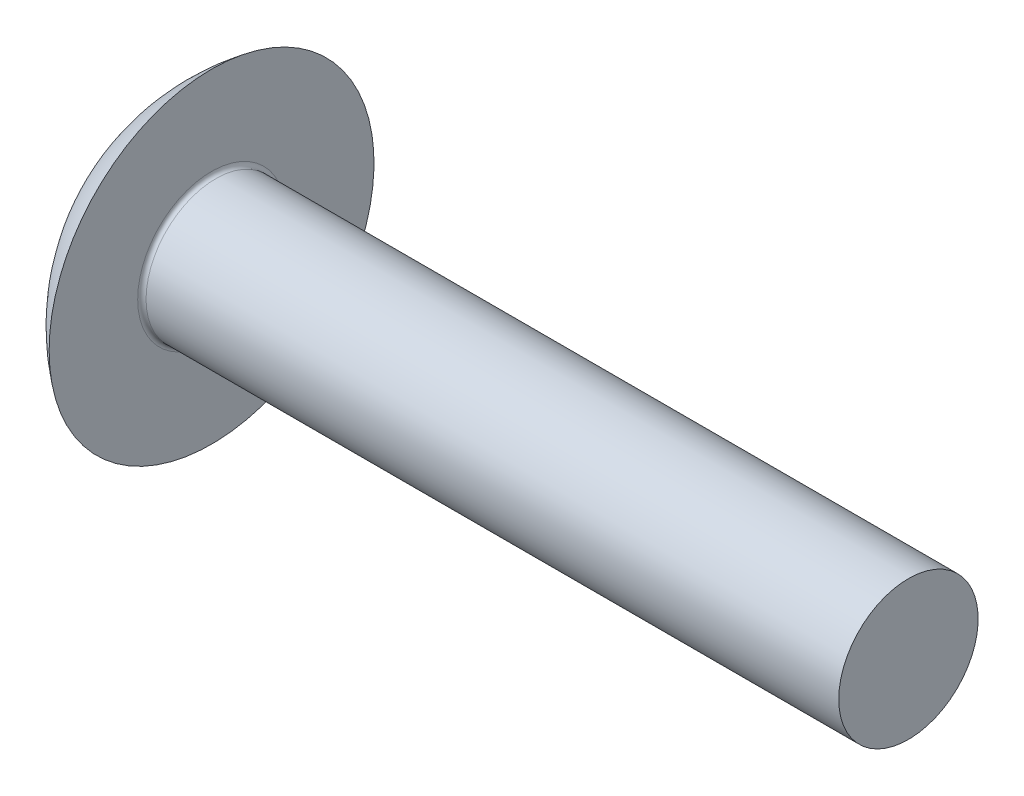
from build123d import *

# Parameters (mm, degrees)
FILLET1_R = 0.3


with BuildPart() as part:
    # Sketch1 → Base-Revolve (revolve)
    with BuildSketch(Plane.XY, mode=Mode.PRIVATE) as base_revolve_sk:
        with BuildLine():
            Line((55.873347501, 0), (55.873347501, 5))
            Line((55.873347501, 5), (5.873347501, 5))
            Line((5.873347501, 5), (5.873347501, 11.654650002))
            ThreePointArc((5.873347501, 11.654650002), (1.55132321, 6.525470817), (0, 0))
            Line((0, 0), (55.873347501, 0))
        make_face()
    revolve(base_revolve_sk.sketch.rotate(Axis((-81.166480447, 0, 0), (1, 0, 0)), 90), axis=Axis((-81.166480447, 0, 0), (1, 0, 0)))

    # Fillet1
    fillet1_edges = [part.edges().sort_by_distance(p)[0] for p in [
        (5.873347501, 0, -5),
    ]]
    fillet(fillet1_edges, radius=FILLET1_R)


solid = part.part
